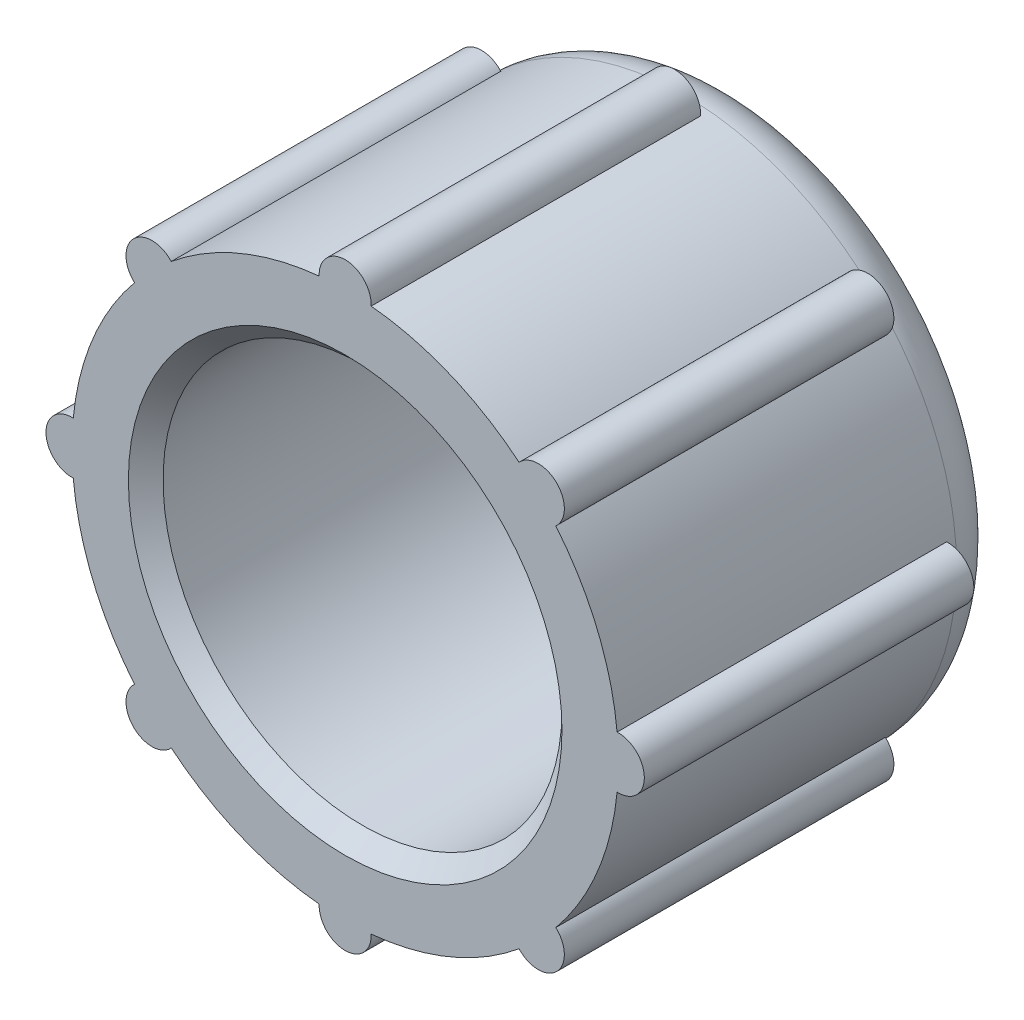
ISO-10303-21;
HEADER;
FILE_DESCRIPTION(('STEP AP214'),'2;1');
FILE_NAME('part.step','',(''),(''),'','','');
FILE_SCHEMA(('AUTOMOTIVE_DESIGN { 1 0 10303 214 1 1 1 1 }'));
ENDSEC;
DATA;
#1=APPLICATION_CONTEXT('core data for automotive mechanical design processes');
#2=APPLICATION_PROTOCOL_DEFINITION('international standard','automotive_design',2000,#1);
#3=PRODUCT_CONTEXT('',#1,'mechanical');
#4=PRODUCT('Part','Part','',(#3));
#5=PRODUCT_RELATED_PRODUCT_CATEGORY('part','',(#4));
#6=PRODUCT_DEFINITION_FORMATION('','',#4);
#7=PRODUCT_DEFINITION_CONTEXT('part definition',#1,'design');
#8=PRODUCT_DEFINITION('design','',#6,#7);
#9=PRODUCT_DEFINITION_SHAPE('','',#8);
#10=(LENGTH_UNIT() NAMED_UNIT(*) SI_UNIT(.MILLI.,.METRE.));
#11=(NAMED_UNIT(*) PLANE_ANGLE_UNIT() SI_UNIT($,.RADIAN.));
#12=(NAMED_UNIT(*) SI_UNIT($,.STERADIAN.) SOLID_ANGLE_UNIT());
#13=UNCERTAINTY_MEASURE_WITH_UNIT(LENGTH_MEASURE(1.E-05),#10,'distance_accuracy_value','');
#14=(GEOMETRIC_REPRESENTATION_CONTEXT(3) GLOBAL_UNCERTAINTY_ASSIGNED_CONTEXT((#13)) GLOBAL_UNIT_ASSIGNED_CONTEXT((#10,
#11,#12)) REPRESENTATION_CONTEXT('',''));
#15=CARTESIAN_POINT('',(0.,0.,0.));
#16=DIRECTION('',(0.,0.,1.));
#17=DIRECTION('',(1.,0.,0.));
#18=AXIS2_PLACEMENT_3D('',#15,#16,#17);
#19=CARTESIAN_POINT('',(0.,0.,-96.5));
#20=DIRECTION('',(0.,0.,1.));
#21=DIRECTION('',(1.,0.,0.));
#22=AXIS2_PLACEMENT_3D('',#19,#20,#21);
#23=CYLINDRICAL_SURFACE('',#22,8.75);
#24=CARTESIAN_POINT('',(0.,0.,0.));
#25=DIRECTION('',(0.,0.,1.));
#26=DIRECTION('',(1.,0.,0.));
#27=AXIS2_PLACEMENT_3D('',#24,#25,#26);
#28=CIRCLE('',#27,8.75);
#29=CARTESIAN_POINT('',(8.75,0.,0.));
#30=VERTEX_POINT('',#29);
#31=EDGE_CURVE('E252',#30,#30,#28,.T.);
#32=ORIENTED_EDGE('',*,*,#31,.F.);
#33=EDGE_LOOP('',(#32));
#34=FACE_BOUND('',#33,.T.);
#35=CARTESIAN_POINT('',(0.,0.,3.5));
#36=DIRECTION('',(0.,0.,1.));
#37=DIRECTION('',(1.,0.,0.));
#38=AXIS2_PLACEMENT_3D('',#35,#36,#37);
#39=CIRCLE('',#38,8.75);
#40=CARTESIAN_POINT('',(8.75,0.,3.5));
#41=VERTEX_POINT('',#40);
#42=EDGE_CURVE('E255',#41,#41,#39,.F.);
#43=ORIENTED_EDGE('',*,*,#42,.F.);
#44=EDGE_LOOP('',(#43));
#45=FACE_BOUND('',#44,.T.);
#46=ADVANCED_FACE('F26',(#34,#45),#23,.F.);
#47=CARTESIAN_POINT('',(0.,0.,22.5));
#48=DIRECTION('',(0.,0.,-1.));
#49=DIRECTION('',(-1.,0.,0.));
#50=AXIS2_PLACEMENT_3D('',#47,#48,#49);
#51=CYLINDRICAL_SURFACE('',#50,15.75);
#52=CARTESIAN_POINT('',(0.,0.,3.));
#53=DIRECTION('',(0.,0.,1.));
#54=DIRECTION('',(1.,0.,0.));
#55=AXIS2_PLACEMENT_3D('',#52,#53,#54);
#56=CIRCLE('',#55,15.75);
#57=CARTESIAN_POINT('',(15.75,0.,3.));
#58=VERTEX_POINT('',#57);
#59=EDGE_CURVE('E34',#58,#58,#56,.T.);
#60=ORIENTED_EDGE('',*,*,#59,.T.);
#61=EDGE_LOOP('',(#60));
#62=FACE_BOUND('',#61,.T.);
#63=CARTESIAN_POINT('',(0.,0.,3.5));
#64=DIRECTION('',(0.,0.,1.));
#65=DIRECTION('',(1.,0.,0.));
#66=AXIS2_PLACEMENT_3D('',#63,#64,#65);
#67=CIRCLE('',#66,15.75);
#68=CARTESIAN_POINT('',(12.1458811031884,10.0269672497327,3.5));
#69=VERTEX_POINT('',#68);
#70=CARTESIAN_POINT('',(10.0269672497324,12.1458811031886,3.5));
#71=VERTEX_POINT('',#70);
#72=EDGE_CURVE('E138',#69,#71,#67,.T.);
#73=ORIENTED_EDGE('',*,*,#72,.F.);
#74=DIRECTION('',(0.,0.,1.));
#75=VECTOR('',#74,1.);
#76=CARTESIAN_POINT('',(12.1458811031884,10.0269672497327,13.));
#77=LINE('',#76,#75);
#78=CARTESIAN_POINT('',(12.1458811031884,10.0269672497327,22.5));
#79=VERTEX_POINT('',#78);
#80=EDGE_CURVE('E152',#69,#79,#77,.T.);
#81=ORIENTED_EDGE('',*,*,#80,.T.);
#82=CARTESIAN_POINT('',(0.,0.,22.5));
#83=DIRECTION('',(0.,0.,1.));
#84=DIRECTION('',(1.,0.,0.));
#85=AXIS2_PLACEMENT_3D('',#82,#83,#84);
#86=CIRCLE('',#85,15.75);
#87=CARTESIAN_POINT('',(15.6785714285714,1.49829835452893,22.5));
#88=VERTEX_POINT('',#87);
#89=EDGE_CURVE('E495',#88,#79,#86,.T.);
#90=ORIENTED_EDGE('',*,*,#89,.F.);
#91=DIRECTION('',(0.,0.,1.));
#92=VECTOR('',#91,1.);
#93=CARTESIAN_POINT('',(15.6785714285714,1.49829835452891,13.));
#94=LINE('',#93,#92);
#95=CARTESIAN_POINT('',(15.6785714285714,1.49829835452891,3.5));
#96=VERTEX_POINT('',#95);
#97=EDGE_CURVE('E164',#88,#96,#94,.F.);
#98=ORIENTED_EDGE('',*,*,#97,.T.);
#99=CARTESIAN_POINT('',(0.,0.,3.5));
#100=DIRECTION('',(0.,0.,1.));
#101=DIRECTION('',(1.,0.,0.));
#102=AXIS2_PLACEMENT_3D('',#99,#100,#101);
#103=CIRCLE('',#102,15.75);
#104=CARTESIAN_POINT('',(15.6785714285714,-1.49829835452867,3.5));
#105=VERTEX_POINT('',#104);
#106=EDGE_CURVE('E146',#105,#96,#103,.T.);
#107=ORIENTED_EDGE('',*,*,#106,.F.);
#108=DIRECTION('',(0.,0.,1.));
#109=VECTOR('',#108,1.);
#110=CARTESIAN_POINT('',(15.6785714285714,-1.49829835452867,13.));
#111=LINE('',#110,#109);
#112=CARTESIAN_POINT('',(15.6785714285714,-1.49829835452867,22.5));
#113=VERTEX_POINT('',#112);
#114=EDGE_CURVE('E167',#105,#113,#111,.T.);
#115=ORIENTED_EDGE('',*,*,#114,.T.);
#116=CARTESIAN_POINT('',(12.1458811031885,-10.0269672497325,22.5));
#117=VERTEX_POINT('',#116);
#118=EDGE_CURVE('E496',#117,#113,#86,.T.);
#119=ORIENTED_EDGE('',*,*,#118,.F.);
#120=DIRECTION('',(0.,0.,1.));
#121=VECTOR('',#120,1.);
#122=CARTESIAN_POINT('',(12.1458811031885,-10.0269672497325,13.));
#123=LINE('',#122,#121);
#124=CARTESIAN_POINT('',(12.1458811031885,-10.0269672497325,3.5));
#125=VERTEX_POINT('',#124);
#126=EDGE_CURVE('E175',#117,#125,#123,.F.);
#127=ORIENTED_EDGE('',*,*,#126,.T.);
#128=CARTESIAN_POINT('',(0.,0.,3.5));
#129=DIRECTION('',(0.,0.,1.));
#130=DIRECTION('',(1.,0.,0.));
#131=AXIS2_PLACEMENT_3D('',#128,#129,#130);
#132=CIRCLE('',#131,15.75);
#133=CARTESIAN_POINT('',(10.0269672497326,-12.1458811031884,3.5));
#134=VERTEX_POINT('',#133);
#135=EDGE_CURVE('E249',#134,#125,#132,.T.);
#136=ORIENTED_EDGE('',*,*,#135,.F.);
#137=DIRECTION('',(0.,0.,1.));
#138=VECTOR('',#137,1.);
#139=CARTESIAN_POINT('',(10.0269672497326,-12.1458811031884,13.));
#140=LINE('',#139,#138);
#141=CARTESIAN_POINT('',(10.0269672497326,-12.1458811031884,22.5));
#142=VERTEX_POINT('',#141);
#143=EDGE_CURVE('E178',#134,#142,#140,.T.);
#144=ORIENTED_EDGE('',*,*,#143,.T.);
#145=CARTESIAN_POINT('',(1.49829835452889,-15.6785714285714,22.5));
#146=VERTEX_POINT('',#145);
#147=EDGE_CURVE('E497',#146,#142,#86,.T.);
#148=ORIENTED_EDGE('',*,*,#147,.F.);
#149=DIRECTION('',(0.,0.,1.));
#150=VECTOR('',#149,1.);
#151=CARTESIAN_POINT('',(1.49829835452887,-15.6785714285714,13.));
#152=LINE('',#151,#150);
#153=CARTESIAN_POINT('',(1.49829835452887,-15.6785714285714,3.5));
#154=VERTEX_POINT('',#153);
#155=EDGE_CURVE('E186',#146,#154,#152,.F.);
#156=ORIENTED_EDGE('',*,*,#155,.T.);
#157=CARTESIAN_POINT('',(0.,0.,3.5));
#158=DIRECTION('',(0.,0.,1.));
#159=DIRECTION('',(1.,0.,0.));
#160=AXIS2_PLACEMENT_3D('',#157,#158,#159);
#161=CIRCLE('',#160,15.75);
#162=CARTESIAN_POINT('',(-1.49829835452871,-15.6785714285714,3.5));
#163=VERTEX_POINT('',#162);
#164=EDGE_CURVE('E247',#163,#154,#161,.T.);
#165=ORIENTED_EDGE('',*,*,#164,.F.);
#166=DIRECTION('',(0.,0.,1.));
#167=VECTOR('',#166,1.);
#168=CARTESIAN_POINT('',(-1.49829835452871,-15.6785714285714,13.));
#169=LINE('',#168,#167);
#170=CARTESIAN_POINT('',(-1.49829835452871,-15.6785714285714,22.5));
#171=VERTEX_POINT('',#170);
#172=EDGE_CURVE('E189',#163,#171,#169,.T.);
#173=ORIENTED_EDGE('',*,*,#172,.T.);
#174=CARTESIAN_POINT('',(-10.0269672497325,-12.1458811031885,22.5));
#175=VERTEX_POINT('',#174);
#176=EDGE_CURVE('E511',#175,#171,#86,.T.);
#177=ORIENTED_EDGE('',*,*,#176,.F.);
#178=DIRECTION('',(0.,0.,1.));
#179=VECTOR('',#178,1.);
#180=CARTESIAN_POINT('',(-10.0269672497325,-12.1458811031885,13.));
#181=LINE('',#180,#179);
#182=CARTESIAN_POINT('',(-10.0269672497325,-12.1458811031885,3.5));
#183=VERTEX_POINT('',#182);
#184=EDGE_CURVE('E197',#175,#183,#181,.F.);
#185=ORIENTED_EDGE('',*,*,#184,.T.);
#186=CARTESIAN_POINT('',(0.,0.,3.5));
#187=DIRECTION('',(0.,0.,1.));
#188=DIRECTION('',(1.,0.,0.));
#189=AXIS2_PLACEMENT_3D('',#186,#187,#188);
#190=CIRCLE('',#189,15.75);
#191=CARTESIAN_POINT('',(-12.1458811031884,-10.0269672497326,3.5));
#192=VERTEX_POINT('',#191);
#193=EDGE_CURVE('E245',#192,#183,#190,.T.);
#194=ORIENTED_EDGE('',*,*,#193,.F.);
#195=DIRECTION('',(0.,0.,1.));
#196=VECTOR('',#195,1.);
#197=CARTESIAN_POINT('',(-12.1458811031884,-10.0269672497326,13.));
#198=LINE('',#197,#196);
#199=CARTESIAN_POINT('',(-12.1458811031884,-10.0269672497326,22.5));
#200=VERTEX_POINT('',#199);
#201=EDGE_CURVE('E200',#192,#200,#198,.T.);
#202=ORIENTED_EDGE('',*,*,#201,.T.);
#203=CARTESIAN_POINT('',(-15.6785714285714,-1.49829835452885,22.5));
#204=VERTEX_POINT('',#203);
#205=EDGE_CURVE('E509',#204,#200,#86,.T.);
#206=ORIENTED_EDGE('',*,*,#205,.F.);
#207=DIRECTION('',(0.,0.,1.));
#208=VECTOR('',#207,1.);
#209=CARTESIAN_POINT('',(-15.6785714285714,-1.49829835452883,13.));
#210=LINE('',#209,#208);
#211=CARTESIAN_POINT('',(-15.6785714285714,-1.49829835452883,3.5));
#212=VERTEX_POINT('',#211);
#213=EDGE_CURVE('E208',#204,#212,#210,.F.);
#214=ORIENTED_EDGE('',*,*,#213,.T.);
#215=CARTESIAN_POINT('',(0.,0.,3.5));
#216=DIRECTION('',(0.,0.,1.));
#217=DIRECTION('',(1.,0.,0.));
#218=AXIS2_PLACEMENT_3D('',#215,#216,#217);
#219=CIRCLE('',#218,15.75);
#220=CARTESIAN_POINT('',(-15.6785714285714,1.49829835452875,3.5));
#221=VERTEX_POINT('',#220);
#222=EDGE_CURVE('E243',#221,#212,#219,.T.);
#223=ORIENTED_EDGE('',*,*,#222,.F.);
#224=DIRECTION('',(0.,0.,1.));
#225=VECTOR('',#224,1.);
#226=CARTESIAN_POINT('',(-15.6785714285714,1.49829835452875,13.));
#227=LINE('',#226,#225);
#228=CARTESIAN_POINT('',(-15.6785714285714,1.49829835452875,22.5));
#229=VERTEX_POINT('',#228);
#230=EDGE_CURVE('E211',#221,#229,#227,.T.);
#231=ORIENTED_EDGE('',*,*,#230,.T.);
#232=CARTESIAN_POINT('',(-12.1458811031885,10.0269672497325,22.5));
#233=VERTEX_POINT('',#232);
#234=EDGE_CURVE('E239',#233,#229,#86,.T.);
#235=ORIENTED_EDGE('',*,*,#234,.F.);
#236=DIRECTION('',(0.,0.,1.));
#237=VECTOR('',#236,1.);
#238=CARTESIAN_POINT('',(-12.1458811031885,10.0269672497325,13.));
#239=LINE('',#238,#237);
#240=CARTESIAN_POINT('',(-12.1458811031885,10.0269672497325,3.5));
#241=VERTEX_POINT('',#240);
#242=EDGE_CURVE('E219',#233,#241,#239,.F.);
#243=ORIENTED_EDGE('',*,*,#242,.T.);
#244=CARTESIAN_POINT('',(0.,0.,3.5));
#245=DIRECTION('',(0.,0.,1.));
#246=DIRECTION('',(1.,0.,0.));
#247=AXIS2_PLACEMENT_3D('',#244,#245,#246);
#248=CIRCLE('',#247,15.75);
#249=CARTESIAN_POINT('',(-10.0269672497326,12.1458811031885,3.5));
#250=VERTEX_POINT('',#249);
#251=EDGE_CURVE('E241',#250,#241,#248,.T.);
#252=ORIENTED_EDGE('',*,*,#251,.F.);
#253=DIRECTION('',(0.,0.,1.));
#254=VECTOR('',#253,1.);
#255=CARTESIAN_POINT('',(-10.0269672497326,12.1458811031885,13.));
#256=LINE('',#255,#254);
#257=CARTESIAN_POINT('',(-10.0269672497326,12.1458811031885,22.5));
#258=VERTEX_POINT('',#257);
#259=EDGE_CURVE('E222',#250,#258,#256,.T.);
#260=ORIENTED_EDGE('',*,*,#259,.T.);
#261=CARTESIAN_POINT('',(-1.4982983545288,15.6785714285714,22.5));
#262=VERTEX_POINT('',#261);
#263=EDGE_CURVE('E235',#262,#258,#86,.T.);
#264=ORIENTED_EDGE('',*,*,#263,.F.);
#265=DIRECTION('',(0.,0.,1.));
#266=VECTOR('',#265,1.);
#267=CARTESIAN_POINT('',(-1.49829835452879,15.6785714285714,13.));
#268=LINE('',#267,#266);
#269=CARTESIAN_POINT('',(-1.49829835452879,15.6785714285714,3.5));
#270=VERTEX_POINT('',#269);
#271=EDGE_CURVE('E230',#262,#270,#268,.F.);
#272=ORIENTED_EDGE('',*,*,#271,.T.);
#273=CARTESIAN_POINT('',(0.,0.,3.5));
#274=DIRECTION('',(0.,0.,1.));
#275=DIRECTION('',(1.,0.,0.));
#276=AXIS2_PLACEMENT_3D('',#273,#274,#275);
#277=CIRCLE('',#276,15.75);
#278=CARTESIAN_POINT('',(1.49829835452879,15.6785714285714,3.5));
#279=VERTEX_POINT('',#278);
#280=EDGE_CURVE('E238',#279,#270,#277,.T.);
#281=ORIENTED_EDGE('',*,*,#280,.F.);
#282=DIRECTION('',(0.,0.,1.));
#283=VECTOR('',#282,1.);
#284=CARTESIAN_POINT('',(1.49829835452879,15.6785714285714,13.));
#285=LINE('',#284,#283);
#286=CARTESIAN_POINT('',(1.49829835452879,15.6785714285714,22.5));
#287=VERTEX_POINT('',#286);
#288=EDGE_CURVE('E233',#279,#287,#285,.T.);
#289=ORIENTED_EDGE('',*,*,#288,.T.);
#290=CARTESIAN_POINT('',(10.0269672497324,12.1458811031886,22.5));
#291=VERTEX_POINT('',#290);
#292=EDGE_CURVE('E155',#291,#287,#86,.T.);
#293=ORIENTED_EDGE('',*,*,#292,.F.);
#294=DIRECTION('',(0.,0.,1.));
#295=VECTOR('',#294,1.);
#296=CARTESIAN_POINT('',(10.0269672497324,12.1458811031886,13.));
#297=LINE('',#296,#295);
#298=EDGE_CURVE('E150',#291,#71,#297,.F.);
#299=ORIENTED_EDGE('',*,*,#298,.T.);
#300=EDGE_LOOP('',(#73,#81,#90,#98,#107,#115,#119,#127,#136,#144,#148,#156,#165,#173,#177,#185,
#194,#202,#206,#214,#223,#231,#235,#243,#252,#260,#264,#272,#281,#289,#293,#299));
#301=FACE_BOUND('',#300,.T.);
#302=ADVANCED_FACE('F28',(#62,#301),#51,.T.);
#303=CARTESIAN_POINT('',(0.,0.,22.5));
#304=DIRECTION('',(0.,0.,1.));
#305=DIRECTION('',(1.,0.,0.));
#306=AXIS2_PLACEMENT_3D('',#303,#304,#305);
#307=PLANE('',#306);
#308=CARTESIAN_POINT('',(0.,0.,22.5));
#309=DIRECTION('',(0.,0.,1.));
#310=DIRECTION('',(1.,0.,0.));
#311=AXIS2_PLACEMENT_3D('',#308,#309,#310);
#312=CIRCLE('',#311,12.5);
#313=CARTESIAN_POINT('',(12.5,0.,22.5));
#314=VERTEX_POINT('',#313);
#315=EDGE_CURVE('E261',#314,#314,#312,.F.);
#316=ORIENTED_EDGE('',*,*,#315,.T.);
#317=EDGE_LOOP('',(#316));
#318=FACE_BOUND('',#317,.T.);
#319=ORIENTED_EDGE('',*,*,#89,.T.);
#320=CARTESIAN_POINT('',(11.136931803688,11.1369318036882,22.5));
#321=DIRECTION('',(0.,0.,1.));
#322=DIRECTION('',(0.707106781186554,-0.707106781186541,0.));
#323=AXIS2_PLACEMENT_3D('',#320,#321,#322);
#324=CIRCLE('',#323,1.5);
#325=EDGE_CURVE('E41',#79,#291,#324,.T.);
#326=ORIENTED_EDGE('',*,*,#325,.T.);
#327=ORIENTED_EDGE('',*,*,#292,.T.);
#328=CARTESIAN_POINT('',(0.,15.75,22.5));
#329=DIRECTION('',(0.,0.,1.));
#330=DIRECTION('',(1.,0.,0.));
#331=AXIS2_PLACEMENT_3D('',#328,#329,#330);
#332=CIRCLE('',#331,1.5);
#333=EDGE_CURVE('E225',#287,#262,#332,.T.);
#334=ORIENTED_EDGE('',*,*,#333,.T.);
#335=ORIENTED_EDGE('',*,*,#263,.T.);
#336=CARTESIAN_POINT('',(-11.1369318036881,11.1369318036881,22.5));
#337=DIRECTION('',(0.,0.,1.));
#338=DIRECTION('',(0.707106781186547,0.707106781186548,0.));
#339=AXIS2_PLACEMENT_3D('',#336,#337,#338);
#340=CIRCLE('',#339,1.5);
#341=EDGE_CURVE('E214',#258,#233,#340,.T.);
#342=ORIENTED_EDGE('',*,*,#341,.T.);
#343=ORIENTED_EDGE('',*,*,#234,.T.);
#344=CARTESIAN_POINT('',(-15.75,0.,22.5));
#345=DIRECTION('',(0.,0.,1.));
#346=DIRECTION('',(0.,1.,0.));
#347=AXIS2_PLACEMENT_3D('',#344,#345,#346);
#348=CIRCLE('',#347,1.5);
#349=EDGE_CURVE('E203',#229,#204,#348,.T.);
#350=ORIENTED_EDGE('',*,*,#349,.T.);
#351=ORIENTED_EDGE('',*,*,#205,.T.);
#352=CARTESIAN_POINT('',(-11.1369318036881,-11.1369318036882,22.5));
#353=DIRECTION('',(0.,0.,1.));
#354=DIRECTION('',(-0.70710678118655,0.707106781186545,0.));
#355=AXIS2_PLACEMENT_3D('',#352,#353,#354);
#356=CIRCLE('',#355,1.5);
#357=EDGE_CURVE('E192',#200,#175,#356,.T.);
#358=ORIENTED_EDGE('',*,*,#357,.T.);
#359=ORIENTED_EDGE('',*,*,#176,.T.);
#360=CARTESIAN_POINT('',(0.,-15.75,22.5));
#361=DIRECTION('',(0.,0.,1.));
#362=DIRECTION('',(-1.,0.,0.));
#363=AXIS2_PLACEMENT_3D('',#360,#361,#362);
#364=CIRCLE('',#363,1.5);
#365=EDGE_CURVE('E181',#171,#146,#364,.T.);
#366=ORIENTED_EDGE('',*,*,#365,.T.);
#367=ORIENTED_EDGE('',*,*,#147,.T.);
#368=CARTESIAN_POINT('',(11.1369318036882,-11.1369318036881,22.5));
#369=DIRECTION('',(0.,0.,1.));
#370=DIRECTION('',(-0.707106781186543,-0.707106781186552,0.));
#371=AXIS2_PLACEMENT_3D('',#368,#369,#370);
#372=CIRCLE('',#371,1.5);
#373=EDGE_CURVE('E170',#142,#117,#372,.T.);
#374=ORIENTED_EDGE('',*,*,#373,.T.);
#375=ORIENTED_EDGE('',*,*,#118,.T.);
#376=CARTESIAN_POINT('',(15.75,1.23006158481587E-13,22.5));
#377=DIRECTION('',(0.,0.,1.));
#378=DIRECTION('',(0.,-1.,0.));
#379=AXIS2_PLACEMENT_3D('',#376,#377,#378);
#380=CIRCLE('',#379,1.5);
#381=EDGE_CURVE('E47',#113,#88,#380,.T.);
#382=ORIENTED_EDGE('',*,*,#381,.T.);
#383=EDGE_LOOP('',(#319,#326,#327,#334,#335,#342,#343,#350,#351,#358,#359,#366,#367,#374,#375,#382));
#384=FACE_BOUND('',#383,.T.);
#385=ADVANCED_FACE('F282',(#318,#384),#307,.T.);
#386=CARTESIAN_POINT('',(0.,0.,0.));
#387=DIRECTION('',(0.,0.,1.));
#388=DIRECTION('',(1.,0.,0.));
#389=AXIS2_PLACEMENT_3D('',#386,#387,#388);
#390=PLANE('',#389);
#391=CARTESIAN_POINT('',(0.,0.,0.));
#392=DIRECTION('',(0.,0.,1.));
#393=DIRECTION('',(1.,0.,0.));
#394=AXIS2_PLACEMENT_3D('',#391,#392,#393);
#395=CIRCLE('',#394,12.75);
#396=CARTESIAN_POINT('',(12.75,0.,0.));
#397=VERTEX_POINT('',#396);
#398=EDGE_CURVE('E11',#397,#397,#395,.F.);
#399=ORIENTED_EDGE('',*,*,#398,.T.);
#400=EDGE_LOOP('',(#399));
#401=FACE_BOUND('',#400,.T.);
#402=ORIENTED_EDGE('',*,*,#31,.T.);
#403=EDGE_LOOP('',(#402));
#404=FACE_BOUND('',#403,.T.);
#405=ADVANCED_FACE('F286',(#401,#404),#390,.F.);
#406=CARTESIAN_POINT('',(0.,15.75,3.5));
#407=DIRECTION('',(0.,0.,1.));
#408=DIRECTION('',(1.,0.,0.));
#409=AXIS2_PLACEMENT_3D('',#406,#407,#408);
#410=PLANE('',#409);
#411=CARTESIAN_POINT('',(0.,15.75,3.5));
#412=DIRECTION('',(0.,0.,1.));
#413=DIRECTION('',(1.,0.,0.));
#414=AXIS2_PLACEMENT_3D('',#411,#412,#413);
#415=CIRCLE('',#414,1.5);
#416=EDGE_CURVE('E227',#279,#270,#415,.T.);
#417=ORIENTED_EDGE('',*,*,#416,.F.);
#418=ORIENTED_EDGE('',*,*,#280,.T.);
#419=EDGE_LOOP('',(#417,#418));
#420=FACE_BOUND('',#419,.T.);
#421=ADVANCED_FACE('F296',(#420),#410,.F.);
#422=CARTESIAN_POINT('',(0.,15.75,3.5));
#423=DIRECTION('',(0.,0.,1.));
#424=DIRECTION('',(1.,0.,0.));
#425=AXIS2_PLACEMENT_3D('',#422,#423,#424);
#426=CYLINDRICAL_SURFACE('',#425,1.5);
#427=ORIENTED_EDGE('',*,*,#288,.F.);
#428=ORIENTED_EDGE('',*,*,#416,.T.);
#429=ORIENTED_EDGE('',*,*,#271,.F.);
#430=ORIENTED_EDGE('',*,*,#333,.F.);
#431=EDGE_LOOP('',(#427,#428,#429,#430));
#432=FACE_BOUND('',#431,.T.);
#433=ADVANCED_FACE('F300',(#432),#426,.T.);
#434=CARTESIAN_POINT('',(-11.1369318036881,11.1369318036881,3.5));
#435=DIRECTION('',(0.,0.,1.));
#436=DIRECTION('',(1.,0.,0.));
#437=AXIS2_PLACEMENT_3D('',#434,#435,#436);
#438=PLANE('',#437);
#439=CARTESIAN_POINT('',(-11.1369318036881,11.1369318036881,3.5));
#440=DIRECTION('',(0.,0.,1.));
#441=DIRECTION('',(0.707106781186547,0.707106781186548,0.));
#442=AXIS2_PLACEMENT_3D('',#439,#440,#441);
#443=CIRCLE('',#442,1.5);
#444=EDGE_CURVE('E216',#250,#241,#443,.T.);
#445=ORIENTED_EDGE('',*,*,#444,.F.);
#446=ORIENTED_EDGE('',*,*,#251,.T.);
#447=EDGE_LOOP('',(#445,#446));
#448=FACE_BOUND('',#447,.T.);
#449=ADVANCED_FACE('F303',(#448),#438,.F.);
#450=CARTESIAN_POINT('',(-11.1369318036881,11.1369318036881,3.5));
#451=DIRECTION('',(0.,0.,1.));
#452=DIRECTION('',(1.,0.,0.));
#453=AXIS2_PLACEMENT_3D('',#450,#451,#452);
#454=CYLINDRICAL_SURFACE('',#453,1.5);
#455=ORIENTED_EDGE('',*,*,#259,.F.);
#456=ORIENTED_EDGE('',*,*,#444,.T.);
#457=ORIENTED_EDGE('',*,*,#242,.F.);
#458=ORIENTED_EDGE('',*,*,#341,.F.);
#459=EDGE_LOOP('',(#455,#456,#457,#458));
#460=FACE_BOUND('',#459,.T.);
#461=ADVANCED_FACE('F308',(#460),#454,.T.);
#462=CARTESIAN_POINT('',(-15.75,0.,3.5));
#463=DIRECTION('',(0.,0.,1.));
#464=DIRECTION('',(1.,0.,0.));
#465=AXIS2_PLACEMENT_3D('',#462,#463,#464);
#466=PLANE('',#465);
#467=CARTESIAN_POINT('',(-15.75,0.,3.5));
#468=DIRECTION('',(0.,0.,1.));
#469=DIRECTION('',(0.,1.,0.));
#470=AXIS2_PLACEMENT_3D('',#467,#468,#469);
#471=CIRCLE('',#470,1.5);
#472=EDGE_CURVE('E205',#221,#212,#471,.T.);
#473=ORIENTED_EDGE('',*,*,#472,.F.);
#474=ORIENTED_EDGE('',*,*,#222,.T.);
#475=EDGE_LOOP('',(#473,#474));
#476=FACE_BOUND('',#475,.T.);
#477=ADVANCED_FACE('F311',(#476),#466,.F.);
#478=CARTESIAN_POINT('',(-15.75,0.,3.5));
#479=DIRECTION('',(0.,0.,1.));
#480=DIRECTION('',(1.,0.,0.));
#481=AXIS2_PLACEMENT_3D('',#478,#479,#480);
#482=CYLINDRICAL_SURFACE('',#481,1.5);
#483=ORIENTED_EDGE('',*,*,#230,.F.);
#484=ORIENTED_EDGE('',*,*,#472,.T.);
#485=ORIENTED_EDGE('',*,*,#213,.F.);
#486=ORIENTED_EDGE('',*,*,#349,.F.);
#487=EDGE_LOOP('',(#483,#484,#485,#486));
#488=FACE_BOUND('',#487,.T.);
#489=ADVANCED_FACE('F316',(#488),#482,.T.);
#490=CARTESIAN_POINT('',(-11.1369318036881,-11.1369318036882,3.5));
#491=DIRECTION('',(0.,0.,1.));
#492=DIRECTION('',(1.,0.,0.));
#493=AXIS2_PLACEMENT_3D('',#490,#491,#492);
#494=PLANE('',#493);
#495=CARTESIAN_POINT('',(-11.1369318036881,-11.1369318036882,3.5));
#496=DIRECTION('',(0.,0.,1.));
#497=DIRECTION('',(-0.70710678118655,0.707106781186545,0.));
#498=AXIS2_PLACEMENT_3D('',#495,#496,#497);
#499=CIRCLE('',#498,1.5);
#500=EDGE_CURVE('E194',#192,#183,#499,.T.);
#501=ORIENTED_EDGE('',*,*,#500,.F.);
#502=ORIENTED_EDGE('',*,*,#193,.T.);
#503=EDGE_LOOP('',(#501,#502));
#504=FACE_BOUND('',#503,.T.);
#505=ADVANCED_FACE('F319',(#504),#494,.F.);
#506=CARTESIAN_POINT('',(-11.1369318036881,-11.1369318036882,3.5));
#507=DIRECTION('',(0.,0.,1.));
#508=DIRECTION('',(1.,0.,0.));
#509=AXIS2_PLACEMENT_3D('',#506,#507,#508);
#510=CYLINDRICAL_SURFACE('',#509,1.5);
#511=ORIENTED_EDGE('',*,*,#201,.F.);
#512=ORIENTED_EDGE('',*,*,#500,.T.);
#513=ORIENTED_EDGE('',*,*,#184,.F.);
#514=ORIENTED_EDGE('',*,*,#357,.F.);
#515=EDGE_LOOP('',(#511,#512,#513,#514));
#516=FACE_BOUND('',#515,.T.);
#517=ADVANCED_FACE('F324',(#516),#510,.T.);
#518=CARTESIAN_POINT('',(0.,-15.75,3.5));
#519=DIRECTION('',(0.,0.,1.));
#520=DIRECTION('',(1.,0.,0.));
#521=AXIS2_PLACEMENT_3D('',#518,#519,#520);
#522=PLANE('',#521);
#523=CARTESIAN_POINT('',(0.,-15.75,3.5));
#524=DIRECTION('',(0.,0.,1.));
#525=DIRECTION('',(-1.,0.,0.));
#526=AXIS2_PLACEMENT_3D('',#523,#524,#525);
#527=CIRCLE('',#526,1.5);
#528=EDGE_CURVE('E183',#163,#154,#527,.T.);
#529=ORIENTED_EDGE('',*,*,#528,.F.);
#530=ORIENTED_EDGE('',*,*,#164,.T.);
#531=EDGE_LOOP('',(#529,#530));
#532=FACE_BOUND('',#531,.T.);
#533=ADVANCED_FACE('F327',(#532),#522,.F.);
#534=CARTESIAN_POINT('',(0.,-15.75,3.5));
#535=DIRECTION('',(0.,0.,1.));
#536=DIRECTION('',(1.,0.,0.));
#537=AXIS2_PLACEMENT_3D('',#534,#535,#536);
#538=CYLINDRICAL_SURFACE('',#537,1.5);
#539=ORIENTED_EDGE('',*,*,#172,.F.);
#540=ORIENTED_EDGE('',*,*,#528,.T.);
#541=ORIENTED_EDGE('',*,*,#155,.F.);
#542=ORIENTED_EDGE('',*,*,#365,.F.);
#543=EDGE_LOOP('',(#539,#540,#541,#542));
#544=FACE_BOUND('',#543,.T.);
#545=ADVANCED_FACE('F332',(#544),#538,.T.);
#546=CARTESIAN_POINT('',(11.1369318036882,-11.1369318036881,3.5));
#547=DIRECTION('',(0.,0.,1.));
#548=DIRECTION('',(1.,0.,0.));
#549=AXIS2_PLACEMENT_3D('',#546,#547,#548);
#550=PLANE('',#549);
#551=CARTESIAN_POINT('',(11.1369318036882,-11.1369318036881,3.5));
#552=DIRECTION('',(0.,0.,1.));
#553=DIRECTION('',(-0.707106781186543,-0.707106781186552,0.));
#554=AXIS2_PLACEMENT_3D('',#551,#552,#553);
#555=CIRCLE('',#554,1.5);
#556=EDGE_CURVE('E172',#134,#125,#555,.T.);
#557=ORIENTED_EDGE('',*,*,#556,.F.);
#558=ORIENTED_EDGE('',*,*,#135,.T.);
#559=EDGE_LOOP('',(#557,#558));
#560=FACE_BOUND('',#559,.T.);
#561=ADVANCED_FACE('F335',(#560),#550,.F.);
#562=CARTESIAN_POINT('',(11.1369318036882,-11.1369318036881,3.5));
#563=DIRECTION('',(0.,0.,1.));
#564=DIRECTION('',(1.,0.,0.));
#565=AXIS2_PLACEMENT_3D('',#562,#563,#564);
#566=CYLINDRICAL_SURFACE('',#565,1.5);
#567=ORIENTED_EDGE('',*,*,#143,.F.);
#568=ORIENTED_EDGE('',*,*,#556,.T.);
#569=ORIENTED_EDGE('',*,*,#126,.F.);
#570=ORIENTED_EDGE('',*,*,#373,.F.);
#571=EDGE_LOOP('',(#567,#568,#569,#570));
#572=FACE_BOUND('',#571,.T.);
#573=ADVANCED_FACE('F340',(#572),#566,.T.);
#574=CARTESIAN_POINT('',(15.75,1.23006158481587E-13,3.5));
#575=DIRECTION('',(0.,0.,1.));
#576=DIRECTION('',(1.,0.,0.));
#577=AXIS2_PLACEMENT_3D('',#574,#575,#576);
#578=PLANE('',#577);
#579=CARTESIAN_POINT('',(15.75,1.23006158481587E-13,3.5));
#580=DIRECTION('',(0.,0.,1.));
#581=DIRECTION('',(0.,-1.,0.));
#582=AXIS2_PLACEMENT_3D('',#579,#580,#581);
#583=CIRCLE('',#582,1.5);
#584=EDGE_CURVE('E161',#105,#96,#583,.T.);
#585=ORIENTED_EDGE('',*,*,#584,.F.);
#586=ORIENTED_EDGE('',*,*,#106,.T.);
#587=EDGE_LOOP('',(#585,#586));
#588=FACE_BOUND('',#587,.T.);
#589=ADVANCED_FACE('F343',(#588),#578,.F.);
#590=CARTESIAN_POINT('',(15.75,1.23006158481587E-13,3.5));
#591=DIRECTION('',(0.,0.,1.));
#592=DIRECTION('',(1.,0.,0.));
#593=AXIS2_PLACEMENT_3D('',#590,#591,#592);
#594=CYLINDRICAL_SURFACE('',#593,1.5);
#595=ORIENTED_EDGE('',*,*,#114,.F.);
#596=ORIENTED_EDGE('',*,*,#584,.T.);
#597=ORIENTED_EDGE('',*,*,#97,.F.);
#598=ORIENTED_EDGE('',*,*,#381,.F.);
#599=EDGE_LOOP('',(#595,#596,#597,#598));
#600=FACE_BOUND('',#599,.T.);
#601=ADVANCED_FACE('F348',(#600),#594,.T.);
#602=CARTESIAN_POINT('',(11.136931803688,11.1369318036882,3.5));
#603=DIRECTION('',(0.,0.,1.));
#604=DIRECTION('',(1.,0.,0.));
#605=AXIS2_PLACEMENT_3D('',#602,#603,#604);
#606=PLANE('',#605);
#607=CARTESIAN_POINT('',(11.136931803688,11.1369318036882,3.5));
#608=DIRECTION('',(0.,0.,1.));
#609=DIRECTION('',(0.707106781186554,-0.707106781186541,0.));
#610=AXIS2_PLACEMENT_3D('',#607,#608,#609);
#611=CIRCLE('',#610,1.5);
#612=EDGE_CURVE('E141',#69,#71,#611,.T.);
#613=ORIENTED_EDGE('',*,*,#612,.F.);
#614=ORIENTED_EDGE('',*,*,#72,.T.);
#615=EDGE_LOOP('',(#613,#614));
#616=FACE_BOUND('',#615,.T.);
#617=ADVANCED_FACE('F140',(#616),#606,.F.);
#618=CARTESIAN_POINT('',(11.136931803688,11.1369318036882,3.5));
#619=DIRECTION('',(0.,0.,1.));
#620=DIRECTION('',(1.,0.,0.));
#621=AXIS2_PLACEMENT_3D('',#618,#619,#620);
#622=CYLINDRICAL_SURFACE('',#621,1.5);
#623=ORIENTED_EDGE('',*,*,#80,.F.);
#624=ORIENTED_EDGE('',*,*,#612,.T.);
#625=ORIENTED_EDGE('',*,*,#298,.F.);
#626=ORIENTED_EDGE('',*,*,#325,.F.);
#627=EDGE_LOOP('',(#623,#624,#625,#626));
#628=FACE_BOUND('',#627,.T.);
#629=ADVANCED_FACE('F149',(#628),#622,.T.);
#630=CARTESIAN_POINT('',(0.,0.,3.5));
#631=DIRECTION('',(0.,0.,1.));
#632=DIRECTION('',(1.,0.,0.));
#633=AXIS2_PLACEMENT_3D('',#630,#631,#632);
#634=PLANE('',#633);
#635=ORIENTED_EDGE('',*,*,#42,.T.);
#636=EDGE_LOOP('',(#635));
#637=FACE_BOUND('',#636,.T.);
#638=CARTESIAN_POINT('',(0.,0.,3.5));
#639=DIRECTION('',(0.,0.,1.));
#640=DIRECTION('',(1.,0.,0.));
#641=AXIS2_PLACEMENT_3D('',#638,#639,#640);
#642=CIRCLE('',#641,11.5);
#643=CARTESIAN_POINT('',(11.5,0.,3.5));
#644=VERTEX_POINT('',#643);
#645=EDGE_CURVE('E258',#644,#644,#642,.T.);
#646=ORIENTED_EDGE('',*,*,#645,.T.);
#647=EDGE_LOOP('',(#646));
#648=FACE_BOUND('',#647,.T.);
#649=ADVANCED_FACE('F356',(#637,#648),#634,.T.);
#650=CARTESIAN_POINT('',(0.,0.,3.5));
#651=DIRECTION('',(0.,0.,1.));
#652=DIRECTION('',(1.,0.,0.));
#653=AXIS2_PLACEMENT_3D('',#650,#651,#652);
#654=CYLINDRICAL_SURFACE('',#653,11.5);
#655=CARTESIAN_POINT('',(0.,0.,21.5));
#656=DIRECTION('',(0.,0.,1.));
#657=DIRECTION('',(1.,0.,0.));
#658=AXIS2_PLACEMENT_3D('',#655,#656,#657);
#659=CIRCLE('',#658,11.5);
#660=CARTESIAN_POINT('',(11.5,0.,21.5));
#661=VERTEX_POINT('',#660);
#662=EDGE_CURVE('E145',#661,#661,#659,.T.);
#663=ORIENTED_EDGE('',*,*,#662,.T.);
#664=EDGE_LOOP('',(#663));
#665=FACE_BOUND('',#664,.T.);
#666=ORIENTED_EDGE('',*,*,#645,.F.);
#667=EDGE_LOOP('',(#666));
#668=FACE_BOUND('',#667,.T.);
#669=ADVANCED_FACE('F275',(#665,#668),#654,.F.);
#670=CARTESIAN_POINT('',(0.,0.,21.5));
#671=DIRECTION('',(0.,0.,1.));
#672=DIRECTION('',(1.,0.,0.));
#673=AXIS2_PLACEMENT_3D('',#670,#671,#672);
#674=CONICAL_SURFACE('',#673,11.5,0.785398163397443);
#675=ORIENTED_EDGE('',*,*,#315,.F.);
#676=EDGE_LOOP('',(#675));
#677=FACE_BOUND('',#676,.T.);
#678=ORIENTED_EDGE('',*,*,#662,.F.);
#679=EDGE_LOOP('',(#678));
#680=FACE_BOUND('',#679,.T.);
#681=ADVANCED_FACE('F269',(#677,#680),#674,.F.);
#682=CARTESIAN_POINT('',(0.,0.,3.));
#683=DIRECTION('',(0.,0.,1.));
#684=DIRECTION('',(1.,0.,0.));
#685=AXIS2_PLACEMENT_3D('',#682,#683,#684);
#686=TOROIDAL_SURFACE('',#685,12.75,3.);
#687=ORIENTED_EDGE('',*,*,#398,.F.);
#688=EDGE_LOOP('',(#687));
#689=FACE_BOUND('',#688,.T.);
#690=ORIENTED_EDGE('',*,*,#59,.F.);
#691=EDGE_LOOP('',(#690));
#692=FACE_BOUND('',#691,.T.);
#693=ADVANCED_FACE('F267',(#689,#692),#686,.T.);
#694=CLOSED_SHELL('',(#46,#302,#385,#405,#421,#433,#449,#461,#477,#489,#505,#517,#533,#545,#561,
#573,#589,#601,#617,#629,#649,#669,#681,#693));
#695=MANIFOLD_SOLID_BREP('B2',#694);
#696=ADVANCED_BREP_SHAPE_REPRESENTATION('',(#18,#695),#14);
#697=SHAPE_DEFINITION_REPRESENTATION(#9,#696);
ENDSEC;
END-ISO-10303-21;
